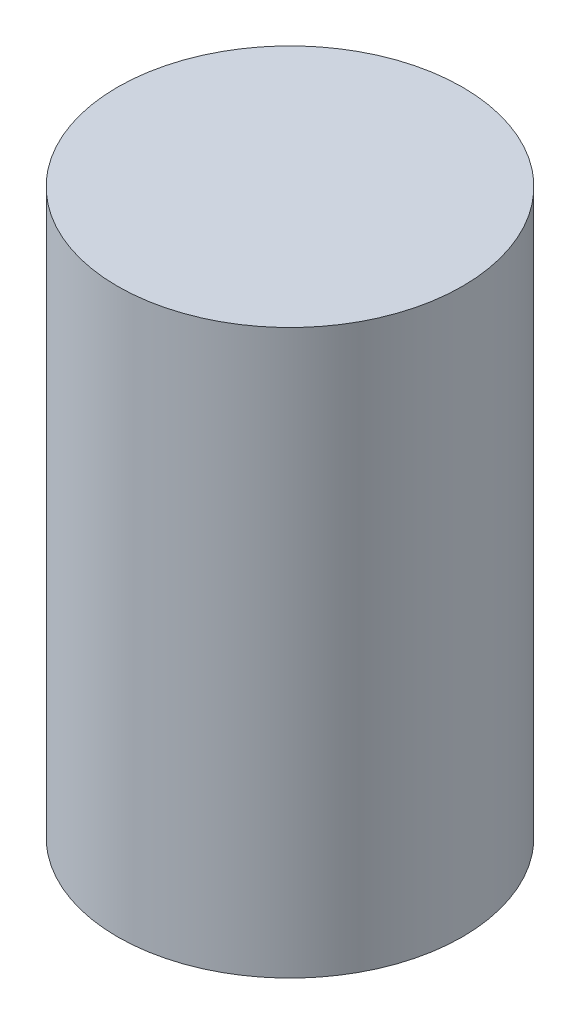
from build123d import *

# Parameters (mm, degrees)
ESQUISSE1_R        = 75
ESQUISSE1_R_2      = 60
BOSS_EXTRU_1_DEPTH = 215
ESQUISSE2_R        = 75
BOSS_EXTRU_3_DEPTH = 30


with BuildPart() as part:
    # Esquisse1 → Boss.-Extru.1 (new body)
    with BuildSketch(Plane(origin=(0, 0, 0), x_dir=(1, 0, 0), z_dir=(0, 1, 0))):
        with Locations(Location((0, 0, 0), (0, 0, 90))):
            Circle(ESQUISSE1_R)
        with Locations(Location((0, 0, 0), (0, 0, 90))):
            Circle(ESQUISSE1_R_2, mode=Mode.SUBTRACT)
    extrude(amount=BOSS_EXTRU_1_DEPTH)

    # Esquisse2 → Boss.-Extru.3 (add)
    with BuildSketch(Plane(origin=(0, 215, 0), x_dir=(1, 0, 0), z_dir=(0, 1, 0))):
        with Locations(Location((0, 0, 0), (0, 0, 90))):
            Circle(ESQUISSE2_R)
    extrude(amount=BOSS_EXTRU_3_DEPTH)


solid = part.part
